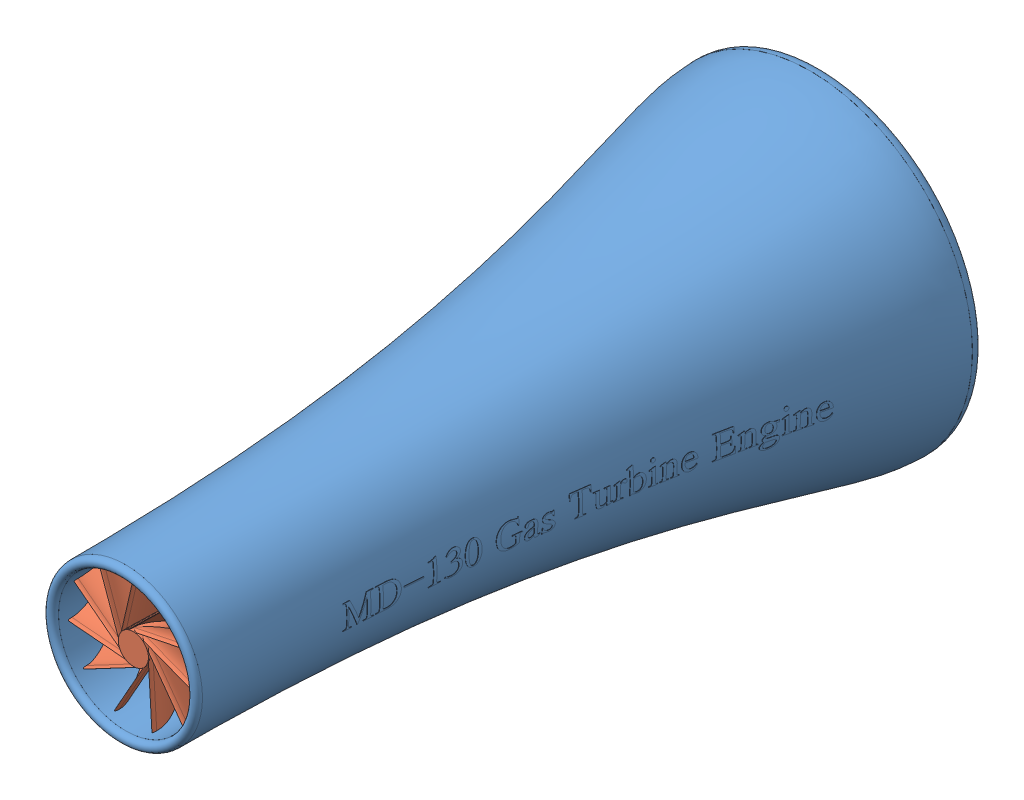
SolidWorks assembly Assem1.sldasm, configuration Default (file format 6000). Lengths in mm.
Overall size (697.31 697.97 1187.49).
2 component instances, 2 part files, 2 mates.
Components (placement in the parent):
- Turbine Shell-1: Turbine Shell.SLDPRT [Default] at origin size (534.47 534.47 1159.99)
- Turbine Shaft and 2 turbines-1: Turbine Shaft and 2 turbines.SLDPRT [Default] at (0.0738 -0.087 -8.5772) x (0.808185 0.588928 0) z (0 0 1) size (497.84 500.85 1162.09)
Mates (geometry in assembly coordinates):
- Concentric1: concentric: circle of Turbine Shell-1; circle of Turbine Shaft and 2 turbines-1
- Distance1: distance = 12.7 mm aligned: plane of Turbine Shell-1 through (-110.6437 0 1084.8928) normal (0 0 1); plane of Turbine Shaft and 2 turbines-1 through (0.0738 -0.087 1072.1928) normal (0 0 1)
